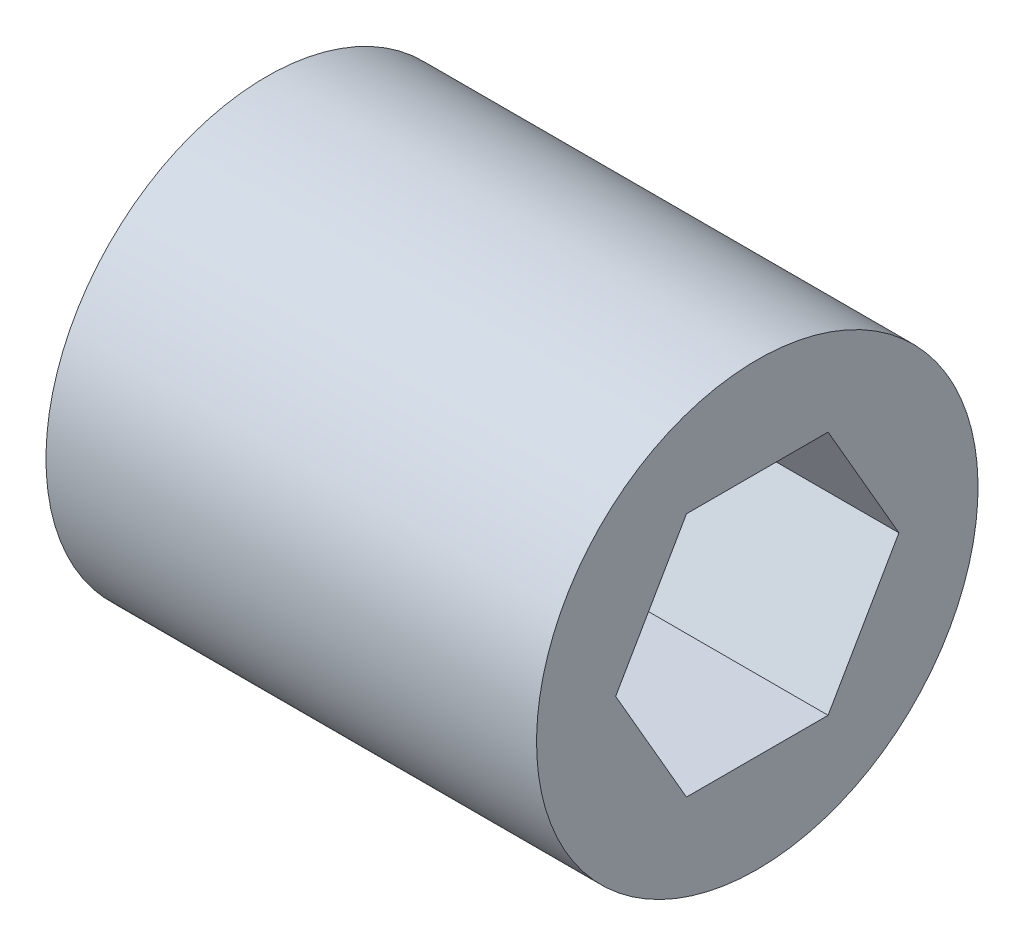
ISO-10303-21;
HEADER;
FILE_DESCRIPTION(('STEP AP214'),'2;1');
FILE_NAME('part.step','',(''),(''),'','','');
FILE_SCHEMA(('AUTOMOTIVE_DESIGN { 1 0 10303 214 1 1 1 1 }'));
ENDSEC;
DATA;
#1=APPLICATION_CONTEXT('core data for automotive mechanical design processes');
#2=APPLICATION_PROTOCOL_DEFINITION('international standard','automotive_design',2000,#1);
#3=PRODUCT_CONTEXT('',#1,'mechanical');
#4=PRODUCT('Part','Part','',(#3));
#5=PRODUCT_RELATED_PRODUCT_CATEGORY('part','',(#4));
#6=PRODUCT_DEFINITION_FORMATION('','',#4);
#7=PRODUCT_DEFINITION_CONTEXT('part definition',#1,'design');
#8=PRODUCT_DEFINITION('design','',#6,#7);
#9=PRODUCT_DEFINITION_SHAPE('','',#8);
#10=(LENGTH_UNIT() NAMED_UNIT(*) SI_UNIT(.MILLI.,.METRE.));
#11=(NAMED_UNIT(*) PLANE_ANGLE_UNIT() SI_UNIT($,.RADIAN.));
#12=(NAMED_UNIT(*) SI_UNIT($,.STERADIAN.) SOLID_ANGLE_UNIT());
#13=UNCERTAINTY_MEASURE_WITH_UNIT(LENGTH_MEASURE(1.E-05),#10,'distance_accuracy_value','');
#14=(GEOMETRIC_REPRESENTATION_CONTEXT(3) GLOBAL_UNCERTAINTY_ASSIGNED_CONTEXT((#13)) GLOBAL_UNIT_ASSIGNED_CONTEXT((#10,
#11,#12)) REPRESENTATION_CONTEXT('',''));
#15=CARTESIAN_POINT('',(0.,0.,0.));
#16=DIRECTION('',(0.,0.,1.));
#17=DIRECTION('',(1.,0.,0.));
#18=AXIS2_PLACEMENT_3D('',#15,#16,#17);
#19=CARTESIAN_POINT('',(5.,2.49999999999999,1.44337567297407));
#20=DIRECTION('',(-1.,0.,0.));
#21=DIRECTION('',(0.,0.,1.));
#22=AXIS2_PLACEMENT_3D('',#19,#20,#21);
#23=PLANE('',#22);
#24=DIRECTION('',(0.,-0.866025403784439,0.5));
#25=VECTOR('',#24,1.);
#26=CARTESIAN_POINT('',(5.,2.49999999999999,1.44337567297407));
#27=LINE('',#26,#25);
#28=CARTESIAN_POINT('',(5.,2.49999999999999,1.44337567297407));
#29=VERTEX_POINT('',#28);
#30=CARTESIAN_POINT('',(5.,1.25,2.16506350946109));
#31=VERTEX_POINT('',#30);
#32=EDGE_CURVE('E432',#29,#31,#27,.T.);
#33=ORIENTED_EDGE('',*,*,#32,.T.);
#34=CARTESIAN_POINT('',(5.,0.,0.));
#35=DIRECTION('',(1.,0.,0.));
#36=DIRECTION('',(0.,1.,0.));
#37=AXIS2_PLACEMENT_3D('',#34,#35,#36);
#38=CIRCLE('',#37,2.5);
#39=CARTESIAN_POINT('',(5.,2.5,0.));
#40=VERTEX_POINT('',#39);
#41=EDGE_CURVE('E366',#40,#31,#38,.T.);
#42=ORIENTED_EDGE('',*,*,#41,.F.);
#43=DIRECTION('',(0.,0.,1.));
#44=VECTOR('',#43,1.);
#45=CARTESIAN_POINT('',(5.,2.49999999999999,-1.44337567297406));
#46=LINE('',#45,#44);
#47=EDGE_CURVE('E429',#40,#29,#46,.T.);
#48=ORIENTED_EDGE('',*,*,#47,.T.);
#49=EDGE_LOOP('',(#33,#42,#48));
#50=FACE_BOUND('',#49,.T.);
#51=ADVANCED_FACE('F350',(#50),#23,.F.);
#52=CARTESIAN_POINT('',(5.,2.49999999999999,-1.44337567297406));
#53=VERTEX_POINT('',#52);
#54=EDGE_CURVE('E439',#53,#40,#46,.T.);
#55=ORIENTED_EDGE('',*,*,#54,.T.);
#56=CARTESIAN_POINT('',(5.,0.,0.));
#57=DIRECTION('',(-1.,0.,0.));
#58=DIRECTION('',(0.,0.,1.));
#59=AXIS2_PLACEMENT_3D('',#56,#57,#58);
#60=CIRCLE('',#59,2.5);
#61=CARTESIAN_POINT('',(5.,1.25,-2.1650635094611));
#62=VERTEX_POINT('',#61);
#63=EDGE_CURVE('E11',#40,#62,#60,.T.);
#64=ORIENTED_EDGE('',*,*,#63,.T.);
#65=DIRECTION('',(0.,0.866025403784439,0.5));
#66=VECTOR('',#65,1.);
#67=CARTESIAN_POINT('',(5.,0.,-2.88675134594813));
#68=LINE('',#67,#66);
#69=EDGE_CURVE('E444',#62,#53,#68,.T.);
#70=ORIENTED_EDGE('',*,*,#69,.T.);
#71=EDGE_LOOP('',(#55,#64,#70));
#72=FACE_BOUND('',#71,.T.);
#73=ADVANCED_FACE('F443',(#72),#23,.F.);
#74=CARTESIAN_POINT('',(5.,0.,-2.88675134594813));
#75=VERTEX_POINT('',#74);
#76=EDGE_CURVE('E441',#75,#62,#68,.T.);
#77=ORIENTED_EDGE('',*,*,#76,.T.);
#78=CARTESIAN_POINT('',(5.,-1.25,-2.1650635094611));
#79=VERTEX_POINT('',#78);
#80=EDGE_CURVE('E359',#62,#79,#60,.T.);
#81=ORIENTED_EDGE('',*,*,#80,.T.);
#82=DIRECTION('',(0.,0.866025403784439,-0.5));
#83=VECTOR('',#82,1.);
#84=CARTESIAN_POINT('',(5.,-2.50000000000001,-1.44337567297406));
#85=LINE('',#84,#83);
#86=EDGE_CURVE('E486',#79,#75,#85,.T.);
#87=ORIENTED_EDGE('',*,*,#86,.T.);
#88=EDGE_LOOP('',(#77,#81,#87));
#89=FACE_BOUND('',#88,.T.);
#90=ADVANCED_FACE('F485',(#89),#23,.F.);
#91=CARTESIAN_POINT('',(5.,-2.50000000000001,-1.44337567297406));
#92=VERTEX_POINT('',#91);
#93=EDGE_CURVE('E493',#92,#79,#85,.T.);
#94=ORIENTED_EDGE('',*,*,#93,.T.);
#95=CARTESIAN_POINT('',(5.,-2.5,0.));
#96=VERTEX_POINT('',#95);
#97=EDGE_CURVE('E474',#79,#96,#60,.T.);
#98=ORIENTED_EDGE('',*,*,#97,.T.);
#99=DIRECTION('',(0.,0.,-1.));
#100=VECTOR('',#99,1.);
#101=CARTESIAN_POINT('',(5.,-2.50000000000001,1.44337567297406));
#102=LINE('',#101,#100);
#103=EDGE_CURVE('E496',#96,#92,#102,.T.);
#104=ORIENTED_EDGE('',*,*,#103,.T.);
#105=EDGE_LOOP('',(#94,#98,#104));
#106=FACE_BOUND('',#105,.T.);
#107=ADVANCED_FACE('F495',(#106),#23,.F.);
#108=CARTESIAN_POINT('',(5.,-2.50000000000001,1.44337567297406));
#109=VERTEX_POINT('',#108);
#110=EDGE_CURVE('E494',#109,#96,#102,.T.);
#111=ORIENTED_EDGE('',*,*,#110,.T.);
#112=CARTESIAN_POINT('',(5.,-1.25,2.1650635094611));
#113=VERTEX_POINT('',#112);
#114=EDGE_CURVE('E469',#96,#113,#60,.T.);
#115=ORIENTED_EDGE('',*,*,#114,.T.);
#116=DIRECTION('',(0.,-0.866025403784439,-0.5));
#117=VECTOR('',#116,1.);
#118=CARTESIAN_POINT('',(5.,0.,2.88675134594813));
#119=LINE('',#118,#117);
#120=EDGE_CURVE('E502',#113,#109,#119,.T.);
#121=ORIENTED_EDGE('',*,*,#120,.T.);
#122=EDGE_LOOP('',(#111,#115,#121));
#123=FACE_BOUND('',#122,.T.);
#124=ADVANCED_FACE('F532',(#123),#23,.F.);
#125=CARTESIAN_POINT('',(10.,0.,0.));
#126=DIRECTION('',(-1.,0.,0.));
#127=DIRECTION('',(0.,-1.,0.));
#128=AXIS2_PLACEMENT_3D('',#125,#126,#127);
#129=PLANE('',#128);
#130=DIRECTION('',(0.,-0.866025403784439,-0.5));
#131=VECTOR('',#130,1.);
#132=CARTESIAN_POINT('',(10.,0.,2.88675134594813));
#133=LINE('',#132,#131);
#134=CARTESIAN_POINT('',(10.,0.,2.88675134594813));
#135=VERTEX_POINT('',#134);
#136=CARTESIAN_POINT('',(10.,-2.50000000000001,1.44337567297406));
#137=VERTEX_POINT('',#136);
#138=EDGE_CURVE('E515',#135,#137,#133,.T.);
#139=ORIENTED_EDGE('',*,*,#138,.F.);
#140=DIRECTION('',(0.,-0.866025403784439,0.5));
#141=VECTOR('',#140,1.);
#142=CARTESIAN_POINT('',(10.,2.49999999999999,1.44337567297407));
#143=LINE('',#142,#141);
#144=CARTESIAN_POINT('',(10.,2.49999999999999,1.44337567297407));
#145=VERTEX_POINT('',#144);
#146=EDGE_CURVE('E374',#145,#135,#143,.T.);
#147=ORIENTED_EDGE('',*,*,#146,.F.);
#148=DIRECTION('',(0.,0.,1.));
#149=VECTOR('',#148,1.);
#150=CARTESIAN_POINT('',(10.,2.49999999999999,-1.44337567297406));
#151=LINE('',#150,#149);
#152=CARTESIAN_POINT('',(10.,2.49999999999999,-1.44337567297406));
#153=VERTEX_POINT('',#152);
#154=EDGE_CURVE('E505',#153,#145,#151,.T.);
#155=ORIENTED_EDGE('',*,*,#154,.F.);
#156=DIRECTION('',(0.,0.866025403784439,0.5));
#157=VECTOR('',#156,1.);
#158=CARTESIAN_POINT('',(10.,0.,-2.88675134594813));
#159=LINE('',#158,#157);
#160=CARTESIAN_POINT('',(10.,0.,-2.88675134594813));
#161=VERTEX_POINT('',#160);
#162=EDGE_CURVE('E507',#161,#153,#159,.T.);
#163=ORIENTED_EDGE('',*,*,#162,.F.);
#164=DIRECTION('',(0.,0.866025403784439,-0.5));
#165=VECTOR('',#164,1.);
#166=CARTESIAN_POINT('',(10.,-2.50000000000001,-1.44337567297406));
#167=LINE('',#166,#165);
#168=CARTESIAN_POINT('',(10.,-2.50000000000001,-1.44337567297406));
#169=VERTEX_POINT('',#168);
#170=EDGE_CURVE('E510',#169,#161,#167,.T.);
#171=ORIENTED_EDGE('',*,*,#170,.F.);
#172=DIRECTION('',(0.,0.,-1.));
#173=VECTOR('',#172,1.);
#174=CARTESIAN_POINT('',(10.,-2.50000000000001,1.44337567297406));
#175=LINE('',#174,#173);
#176=EDGE_CURVE('E512',#137,#169,#175,.T.);
#177=ORIENTED_EDGE('',*,*,#176,.F.);
#178=EDGE_LOOP('',(#139,#147,#155,#163,#171,#177));
#179=FACE_BOUND('',#178,.T.);
#180=CARTESIAN_POINT('',(10.,0.,0.));
#181=DIRECTION('',(-1.,0.,0.));
#182=DIRECTION('',(0.,-1.,0.));
#183=AXIS2_PLACEMENT_3D('',#180,#181,#182);
#184=CIRCLE('',#183,4.50000000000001);
#185=CARTESIAN_POINT('',(9.99999999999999,-4.50000000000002,0.));
#186=VERTEX_POINT('',#185);
#187=EDGE_CURVE('E465',#186,#186,#184,.T.);
#188=ORIENTED_EDGE('',*,*,#187,.F.);
#189=EDGE_LOOP('',(#188));
#190=FACE_BOUND('',#189,.T.);
#191=ADVANCED_FACE('F352',(#179,#190),#129,.F.);
#192=CARTESIAN_POINT('',(0.,0.,0.));
#193=DIRECTION('',(-1.,0.,0.));
#194=DIRECTION('',(0.,-1.,0.));
#195=AXIS2_PLACEMENT_3D('',#192,#193,#194);
#196=CYLINDRICAL_SURFACE('',#195,4.5);
#197=CARTESIAN_POINT('',(0.,0.,0.));
#198=DIRECTION('',(-1.,0.,0.));
#199=DIRECTION('',(0.,-1.,0.));
#200=AXIS2_PLACEMENT_3D('',#197,#198,#199);
#201=CIRCLE('',#200,4.5);
#202=CARTESIAN_POINT('',(0.,-4.5,0.));
#203=VERTEX_POINT('',#202);
#204=EDGE_CURVE('E463',#203,#203,#201,.T.);
#205=ORIENTED_EDGE('',*,*,#204,.F.);
#206=EDGE_LOOP('',(#205));
#207=FACE_BOUND('',#206,.T.);
#208=ORIENTED_EDGE('',*,*,#187,.T.);
#209=EDGE_LOOP('',(#208));
#210=FACE_BOUND('',#209,.T.);
#211=ADVANCED_FACE('F560',(#207,#210),#196,.T.);
#212=CARTESIAN_POINT('',(0.,4.,0.));
#213=DIRECTION('',(1.,0.,0.));
#214=DIRECTION('',(0.,1.,0.));
#215=AXIS2_PLACEMENT_3D('',#212,#213,#214);
#216=PLANE('',#215);
#217=CARTESIAN_POINT('',(0.,0.,0.));
#218=DIRECTION('',(-1.,0.,0.));
#219=DIRECTION('',(0.,-1.,0.));
#220=AXIS2_PLACEMENT_3D('',#217,#218,#219);
#221=CIRCLE('',#220,4.);
#222=CARTESIAN_POINT('',(0.,-4.,0.));
#223=VERTEX_POINT('',#222);
#224=EDGE_CURVE('E453',#223,#223,#221,.T.);
#225=ORIENTED_EDGE('',*,*,#224,.F.);
#226=EDGE_LOOP('',(#225));
#227=FACE_BOUND('',#226,.T.);
#228=ORIENTED_EDGE('',*,*,#204,.T.);
#229=EDGE_LOOP('',(#228));
#230=FACE_BOUND('',#229,.T.);
#231=ADVANCED_FACE('F558',(#227,#230),#216,.F.);
#232=CARTESIAN_POINT('',(0.,0.,0.));
#233=DIRECTION('',(-1.,0.,0.));
#234=DIRECTION('',(0.,1.,0.));
#235=AXIS2_PLACEMENT_3D('',#232,#233,#234);
#236=SPHERICAL_SURFACE('',#235,4.);
#237=CARTESIAN_POINT('',(3.1224989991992,0.,0.));
#238=DIRECTION('',(-1.,0.,0.));
#239=DIRECTION('',(0.,-1.,0.));
#240=AXIS2_PLACEMENT_3D('',#237,#238,#239);
#241=CIRCLE('',#240,2.5);
#242=CARTESIAN_POINT('',(3.1224989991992,-2.5,0.));
#243=VERTEX_POINT('',#242);
#244=EDGE_CURVE('E433',#243,#243,#241,.F.);
#245=ORIENTED_EDGE('',*,*,#244,.T.);
#246=EDGE_LOOP('',(#245));
#247=FACE_BOUND('',#246,.T.);
#248=ORIENTED_EDGE('',*,*,#224,.T.);
#249=EDGE_LOOP('',(#248));
#250=FACE_BOUND('',#249,.T.);
#251=ADVANCED_FACE('F522',(#247,#250),#236,.F.);
#252=CARTESIAN_POINT('',(5.,2.49999999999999,1.44337567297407));
#253=DIRECTION('',(0.,0.5,0.866025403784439));
#254=DIRECTION('',(0.,-0.866025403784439,0.5));
#255=AXIS2_PLACEMENT_3D('',#252,#253,#254);
#256=PLANE('',#255);
#257=ORIENTED_EDGE('',*,*,#146,.T.);
#258=DIRECTION('',(1.,0.,0.));
#259=VECTOR('',#258,1.);
#260=CARTESIAN_POINT('',(5.,0.,2.88675134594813));
#261=LINE('',#260,#259);
#262=CARTESIAN_POINT('',(5.,0.,2.88675134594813));
#263=VERTEX_POINT('',#262);
#264=EDGE_CURVE('E446',#263,#135,#261,.T.);
#265=ORIENTED_EDGE('',*,*,#264,.F.);
#266=EDGE_CURVE('E504',#31,#263,#27,.T.);
#267=ORIENTED_EDGE('',*,*,#266,.F.);
#268=ORIENTED_EDGE('',*,*,#32,.F.);
#269=DIRECTION('',(1.,0.,0.));
#270=VECTOR('',#269,1.);
#271=CARTESIAN_POINT('',(5.,2.49999999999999,1.44337567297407));
#272=LINE('',#271,#270);
#273=EDGE_CURVE('E440',#29,#145,#272,.T.);
#274=ORIENTED_EDGE('',*,*,#273,.T.);
#275=EDGE_LOOP('',(#257,#265,#267,#268,#274));
#276=FACE_BOUND('',#275,.T.);
#277=ADVANCED_FACE('F541',(#276),#256,.F.);
#278=CARTESIAN_POINT('',(5.,2.49999999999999,-1.44337567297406));
#279=DIRECTION('',(0.,1.,0.));
#280=DIRECTION('',(0.,0.,1.));
#281=AXIS2_PLACEMENT_3D('',#278,#279,#280);
#282=PLANE('',#281);
#283=ORIENTED_EDGE('',*,*,#154,.T.);
#284=ORIENTED_EDGE('',*,*,#273,.F.);
#285=ORIENTED_EDGE('',*,*,#47,.F.);
#286=ORIENTED_EDGE('',*,*,#54,.F.);
#287=DIRECTION('',(1.,0.,0.));
#288=VECTOR('',#287,1.);
#289=CARTESIAN_POINT('',(5.,2.49999999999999,-1.44337567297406));
#290=LINE('',#289,#288);
#291=EDGE_CURVE('E454',#53,#153,#290,.T.);
#292=ORIENTED_EDGE('',*,*,#291,.T.);
#293=EDGE_LOOP('',(#283,#284,#285,#286,#292));
#294=FACE_BOUND('',#293,.T.);
#295=ADVANCED_FACE('F438',(#294),#282,.F.);
#296=CARTESIAN_POINT('',(5.,0.,-2.88675134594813));
#297=DIRECTION('',(0.,0.5,-0.866025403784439));
#298=DIRECTION('',(0.,0.866025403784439,0.5));
#299=AXIS2_PLACEMENT_3D('',#296,#297,#298);
#300=PLANE('',#299);
#301=ORIENTED_EDGE('',*,*,#162,.T.);
#302=ORIENTED_EDGE('',*,*,#291,.F.);
#303=ORIENTED_EDGE('',*,*,#69,.F.);
#304=ORIENTED_EDGE('',*,*,#76,.F.);
#305=DIRECTION('',(1.,0.,0.));
#306=VECTOR('',#305,1.);
#307=CARTESIAN_POINT('',(5.,0.,-2.88675134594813));
#308=LINE('',#307,#306);
#309=EDGE_CURVE('E456',#75,#161,#308,.T.);
#310=ORIENTED_EDGE('',*,*,#309,.T.);
#311=EDGE_LOOP('',(#301,#302,#303,#304,#310));
#312=FACE_BOUND('',#311,.T.);
#313=ADVANCED_FACE('F540',(#312),#300,.F.);
#314=CARTESIAN_POINT('',(5.,-2.50000000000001,-1.44337567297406));
#315=DIRECTION('',(0.,-0.5,-0.866025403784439));
#316=DIRECTION('',(0.,0.866025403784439,-0.5));
#317=AXIS2_PLACEMENT_3D('',#314,#315,#316);
#318=PLANE('',#317);
#319=ORIENTED_EDGE('',*,*,#170,.T.);
#320=ORIENTED_EDGE('',*,*,#309,.F.);
#321=ORIENTED_EDGE('',*,*,#86,.F.);
#322=ORIENTED_EDGE('',*,*,#93,.F.);
#323=DIRECTION('',(1.,0.,0.));
#324=VECTOR('',#323,1.);
#325=CARTESIAN_POINT('',(5.,-2.50000000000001,-1.44337567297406));
#326=LINE('',#325,#324);
#327=EDGE_CURVE('E458',#92,#169,#326,.T.);
#328=ORIENTED_EDGE('',*,*,#327,.T.);
#329=EDGE_LOOP('',(#319,#320,#321,#322,#328));
#330=FACE_BOUND('',#329,.T.);
#331=ADVANCED_FACE('F492',(#330),#318,.F.);
#332=CARTESIAN_POINT('',(5.,-2.50000000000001,1.44337567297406));
#333=DIRECTION('',(0.,-1.,0.));
#334=DIRECTION('',(1.,0.,0.));
#335=AXIS2_PLACEMENT_3D('',#332,#333,#334);
#336=PLANE('',#335);
#337=ORIENTED_EDGE('',*,*,#176,.T.);
#338=ORIENTED_EDGE('',*,*,#327,.F.);
#339=ORIENTED_EDGE('',*,*,#103,.F.);
#340=ORIENTED_EDGE('',*,*,#110,.F.);
#341=DIRECTION('',(1.,0.,0.));
#342=VECTOR('',#341,1.);
#343=CARTESIAN_POINT('',(5.,-2.50000000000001,1.44337567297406));
#344=LINE('',#343,#342);
#345=EDGE_CURVE('E447',#109,#137,#344,.T.);
#346=ORIENTED_EDGE('',*,*,#345,.T.);
#347=EDGE_LOOP('',(#337,#338,#339,#340,#346));
#348=FACE_BOUND('',#347,.T.);
#349=ADVANCED_FACE('F547',(#348),#336,.F.);
#350=CARTESIAN_POINT('',(5.,0.,2.88675134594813));
#351=DIRECTION('',(0.,-0.5,0.866025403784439));
#352=DIRECTION('',(0.,-0.866025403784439,-0.5));
#353=AXIS2_PLACEMENT_3D('',#350,#351,#352);
#354=PLANE('',#353);
#355=ORIENTED_EDGE('',*,*,#138,.T.);
#356=ORIENTED_EDGE('',*,*,#345,.F.);
#357=ORIENTED_EDGE('',*,*,#120,.F.);
#358=EDGE_CURVE('E500',#263,#113,#119,.T.);
#359=ORIENTED_EDGE('',*,*,#358,.F.);
#360=ORIENTED_EDGE('',*,*,#264,.T.);
#361=EDGE_LOOP('',(#355,#356,#357,#359,#360));
#362=FACE_BOUND('',#361,.T.);
#363=ADVANCED_FACE('F530',(#362),#354,.F.);
#364=ORIENTED_EDGE('',*,*,#358,.T.);
#365=EDGE_CURVE('E354',#113,#31,#60,.T.);
#366=ORIENTED_EDGE('',*,*,#365,.T.);
#367=ORIENTED_EDGE('',*,*,#266,.T.);
#368=EDGE_LOOP('',(#364,#366,#367));
#369=FACE_BOUND('',#368,.T.);
#370=ADVANCED_FACE('F525',(#369),#23,.F.);
#371=CARTESIAN_POINT('',(0.,0.,0.));
#372=DIRECTION('',(1.,0.,0.));
#373=DIRECTION('',(0.,1.,0.));
#374=AXIS2_PLACEMENT_3D('',#371,#372,#373);
#375=CYLINDRICAL_SURFACE('',#374,2.5);
#376=ORIENTED_EDGE('',*,*,#41,.T.);
#377=ORIENTED_EDGE('',*,*,#365,.F.);
#378=ORIENTED_EDGE('',*,*,#114,.F.);
#379=ORIENTED_EDGE('',*,*,#97,.F.);
#380=ORIENTED_EDGE('',*,*,#80,.F.);
#381=ORIENTED_EDGE('',*,*,#63,.F.);
#382=EDGE_LOOP('',(#376,#377,#378,#379,#380,#381));
#383=FACE_BOUND('',#382,.T.);
#384=ORIENTED_EDGE('',*,*,#244,.F.);
#385=EDGE_LOOP('',(#384));
#386=FACE_BOUND('',#385,.T.);
#387=ADVANCED_FACE('F420',(#383,#386),#375,.F.);
#388=CLOSED_SHELL('',(#51,#73,#90,#107,#124,#191,#211,#231,#251,#277,#295,#313,#331,#349,#363,
#370,#387));
#389=MANIFOLD_SOLID_BREP('B2',#388);
#390=ADVANCED_BREP_SHAPE_REPRESENTATION('',(#18,#389),#14);
#391=SHAPE_DEFINITION_REPRESENTATION(#9,#390);
ENDSEC;
END-ISO-10303-21;
